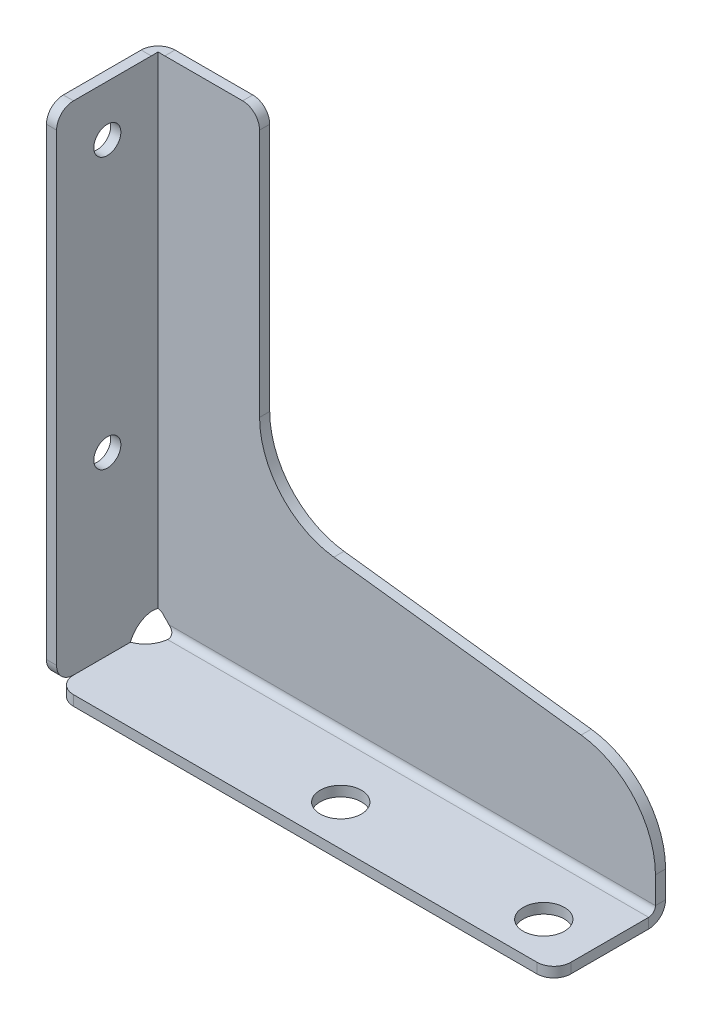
ISO-10303-21;
HEADER;
FILE_DESCRIPTION(('STEP AP214'),'2;1');
FILE_NAME('part.step','',(''),(''),'','','');
FILE_SCHEMA(('AUTOMOTIVE_DESIGN { 1 0 10303 214 1 1 1 1 }'));
ENDSEC;
DATA;
#1=APPLICATION_CONTEXT('core data for automotive mechanical design processes');
#2=APPLICATION_PROTOCOL_DEFINITION('international standard','automotive_design',2000,#1);
#3=PRODUCT_CONTEXT('',#1,'mechanical');
#4=PRODUCT('Part','Part','',(#3));
#5=PRODUCT_RELATED_PRODUCT_CATEGORY('part','',(#4));
#6=PRODUCT_DEFINITION_FORMATION('','',#4);
#7=PRODUCT_DEFINITION_CONTEXT('part definition',#1,'design');
#8=PRODUCT_DEFINITION('design','',#6,#7);
#9=PRODUCT_DEFINITION_SHAPE('','',#8);
#10=(LENGTH_UNIT() NAMED_UNIT(*) SI_UNIT(.MILLI.,.METRE.));
#11=(NAMED_UNIT(*) PLANE_ANGLE_UNIT() SI_UNIT($,.RADIAN.));
#12=(NAMED_UNIT(*) SI_UNIT($,.STERADIAN.) SOLID_ANGLE_UNIT());
#13=UNCERTAINTY_MEASURE_WITH_UNIT(LENGTH_MEASURE(1.E-05),#10,'distance_accuracy_value','');
#14=(GEOMETRIC_REPRESENTATION_CONTEXT(3) GLOBAL_UNCERTAINTY_ASSIGNED_CONTEXT((#13)) GLOBAL_UNIT_ASSIGNED_CONTEXT((#10,
#11,#12)) REPRESENTATION_CONTEXT('',''));
#15=CARTESIAN_POINT('',(0.,0.,0.));
#16=DIRECTION('',(0.,0.,1.));
#17=DIRECTION('',(1.,0.,0.));
#18=AXIS2_PLACEMENT_3D('',#15,#16,#17);
#19=CARTESIAN_POINT('',(136.178536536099,5.85380587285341,3.));
#20=DIRECTION('',(-1.,0.,0.));
#21=DIRECTION('',(0.,0.,1.));
#22=AXIS2_PLACEMENT_3D('',#19,#20,#21);
#23=PLANE('',#22);
#24=DIRECTION('',(0.,1.,0.));
#25=VECTOR('',#24,1.);
#26=CARTESIAN_POINT('',(136.178536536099,5.85380587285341,3.));
#27=LINE('',#26,#25);
#28=CARTESIAN_POINT('',(136.178536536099,-2.03027536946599,3.));
#29=VERTEX_POINT('',#28);
#30=CARTESIAN_POINT('',(136.178536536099,5.85380587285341,3.));
#31=VERTEX_POINT('',#30);
#32=EDGE_CURVE('E318',#29,#31,#27,.T.);
#33=ORIENTED_EDGE('',*,*,#32,.F.);
#34=DIRECTION('',(0.,0.,-1.));
#35=VECTOR('',#34,1.);
#36=CARTESIAN_POINT('',(136.178536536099,-2.030275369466,2.99999999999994));
#37=LINE('',#36,#35);
#38=CARTESIAN_POINT('',(136.178536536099,-2.03027536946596,0.));
#39=VERTEX_POINT('',#38);
#40=EDGE_CURVE('E461',#29,#39,#37,.T.);
#41=ORIENTED_EDGE('',*,*,#40,.T.);
#42=DIRECTION('',(0.,1.,0.));
#43=VECTOR('',#42,1.);
#44=CARTESIAN_POINT('',(136.178536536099,5.85380587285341,0.));
#45=LINE('',#44,#43);
#46=CARTESIAN_POINT('',(136.178536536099,5.85380587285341,0.));
#47=VERTEX_POINT('',#46);
#48=EDGE_CURVE('E323',#39,#47,#45,.T.);
#49=ORIENTED_EDGE('',*,*,#48,.T.);
#50=DIRECTION('',(0.,0.,-1.));
#51=VECTOR('',#50,1.);
#52=CARTESIAN_POINT('',(136.178536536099,5.85380587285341,3.));
#53=LINE('',#52,#51);
#54=EDGE_CURVE('E324',#31,#47,#53,.T.);
#55=ORIENTED_EDGE('',*,*,#54,.F.);
#56=EDGE_LOOP('',(#33,#41,#49,#55));
#57=FACE_BOUND('',#56,.T.);
#58=ADVANCED_FACE('F60',(#57),#23,.F.);
#59=CARTESIAN_POINT('',(44.1785365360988,64.4558627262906,3.));
#60=DIRECTION('',(0.,0.,-1.));
#61=DIRECTION('',(-1.,0.,0.));
#62=AXIS2_PLACEMENT_3D('',#59,#60,#61);
#63=PLANE('',#62);
#64=DIRECTION('',(0.,1.,0.));
#65=VECTOR('',#64,1.);
#66=CARTESIAN_POINT('',(19.1785365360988,142.971937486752,3.));
#67=LINE('',#66,#65);
#68=CARTESIAN_POINT('',(19.1785365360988,64.4558627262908,3.));
#69=VERTEX_POINT('',#68);
#70=CARTESIAN_POINT('',(19.1785365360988,137.971937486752,3.));
#71=VERTEX_POINT('',#70);
#72=EDGE_CURVE('E309',#69,#71,#67,.T.);
#73=ORIENTED_EDGE('',*,*,#72,.T.);
#74=CARTESIAN_POINT('',(14.1785365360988,137.971937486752,3.));
#75=DIRECTION('',(0.,0.,-1.));
#76=DIRECTION('',(-1.,0.,0.));
#77=AXIS2_PLACEMENT_3D('',#74,#75,#76);
#78=CIRCLE('',#77,5.);
#79=CARTESIAN_POINT('',(14.1785365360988,142.971937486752,3.));
#80=VERTEX_POINT('',#79);
#81=EDGE_CURVE('E68',#71,#80,#78,.F.);
#82=ORIENTED_EDGE('',*,*,#81,.T.);
#83=DIRECTION('',(-1.,0.,0.));
#84=VECTOR('',#83,1.);
#85=CARTESIAN_POINT('',(-42.3214634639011,142.971937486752,3.));
#86=LINE('',#85,#84);
#87=CARTESIAN_POINT('',(-8.823676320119,142.971937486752,3.));
#88=VERTEX_POINT('',#87);
#89=EDGE_CURVE('E319',#80,#88,#86,.T.);
#90=ORIENTED_EDGE('',*,*,#89,.T.);
#91=DIRECTION('',(-1.,0.,0.));
#92=VECTOR('',#91,1.);
#93=CARTESIAN_POINT('',(-8.823676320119,142.971937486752,3.));
#94=LINE('',#93,#92);
#95=CARTESIAN_POINT('',(-10.823676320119,142.971937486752,3.));
#96=VERTEX_POINT('',#95);
#97=EDGE_CURVE('E1083',#88,#96,#94,.T.);
#98=ORIENTED_EDGE('',*,*,#97,.T.);
#99=DIRECTION('',(0.,1.,0.));
#100=VECTOR('',#99,1.);
#101=CARTESIAN_POINT('',(-10.8236763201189,-7.03880036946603,3.));
#102=LINE('',#101,#100);
#103=CARTESIAN_POINT('',(-10.8236763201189,0.571064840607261,3.));
#104=VERTEX_POINT('',#103);
#105=EDGE_CURVE('E646',#104,#96,#102,.T.);
#106=ORIENTED_EDGE('',*,*,#105,.F.);
#107=CARTESIAN_POINT('',(-8.82367632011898,-0.794754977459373,3.));
#108=CARTESIAN_POINT('',(-8.8664197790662,-0.738760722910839,3.));
#109=CARTESIAN_POINT('',(-8.9099187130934,-0.683318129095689,3.));
#110=CARTESIAN_POINT('',(-8.99901684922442,-0.573683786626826,3.));
#111=CARTESIAN_POINT('',(-9.04462557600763,-0.519499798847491,3.));
#112=CARTESIAN_POINT('',(-9.13818522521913,-0.413017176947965,3.));
#113=CARTESIAN_POINT('',(-9.18613994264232,-0.360721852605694,3.));
#114=CARTESIAN_POINT('',(-9.28471912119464,-0.258618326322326,3.));
#115=CARTESIAN_POINT('',(-9.33534561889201,-0.208812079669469,3.));
#116=CARTESIAN_POINT('',(-9.43945620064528,-0.11243089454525,3.));
#117=CARTESIAN_POINT('',(-9.49293560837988,-0.0658509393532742,3.));
#118=CARTESIAN_POINT('',(-9.60293380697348,0.0234646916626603,3.));
#119=CARTESIAN_POINT('',(-9.65944953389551,0.066204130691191,3.));
#120=CARTESIAN_POINT('',(-9.78702273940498,0.155306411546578,3.));
#121=CARTESIAN_POINT('',(-9.85875023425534,0.20072201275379,3.));
#122=CARTESIAN_POINT('',(-9.96929129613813,0.263645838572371,3.));
#123=CARTESIAN_POINT('',(-10.006645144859,0.283760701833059,3.));
#124=CARTESIAN_POINT('',(-10.0822474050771,0.322241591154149,3.));
#125=CARTESIAN_POINT('',(-10.1204958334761,0.340607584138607,3.));
#126=CARTESIAN_POINT('',(-10.1976328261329,0.375530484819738,3.));
#127=CARTESIAN_POINT('',(-10.236518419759,0.392093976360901,3.));
#128=CARTESIAN_POINT('',(-10.3149600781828,0.423548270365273,3.));
#129=CARTESIAN_POINT('',(-10.3545161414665,0.43843907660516,3.));
#130=CARTESIAN_POINT('',(-10.4142677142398,0.459560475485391,3.));
#131=CARTESIAN_POINT('',(-10.4342508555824,0.466397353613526,3.));
#132=CARTESIAN_POINT('',(-10.4743671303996,0.479615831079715,3.));
#133=CARTESIAN_POINT('',(-10.4945002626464,0.48599743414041,3.));
#134=CARTESIAN_POINT('',(-10.555086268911,0.504517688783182,3.));
#135=CARTESIAN_POINT('',(-10.5957307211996,0.516033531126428,3.));
#136=CARTESIAN_POINT('',(-10.6675660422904,0.534982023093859,3.));
#137=CARTESIAN_POINT('',(-10.698675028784,0.542729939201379,3.));
#138=CARTESIAN_POINT('',(-10.7610580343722,0.557453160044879,3.));
#139=CARTESIAN_POINT('',(-10.792331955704,0.564428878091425,3.));
#140=CARTESIAN_POINT('',(-10.8236763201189,0.571064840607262,3.));
#141=B_SPLINE_CURVE_WITH_KNOTS('',3,(#107,#108,#109,#110,#111,#112,#113,#114,#115,#116,#117,
#118,#119,#120,#121,#122,#123,#124,#125,#126,#127,#128,#129,#130,#131,#132,#133,#134,#135,#136,
#137,#138,#139,#140),.UNSPECIFIED.,.F.,.F.,(4,2,2,2,2,2,2,2,2,2,2,2,2,2,2,2,4),(0.,
0.211355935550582,0.423782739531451,0.636565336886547,0.84951253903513,1.06212081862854,
1.27451844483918,1.52879656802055,1.656035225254,1.78327628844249,1.91003577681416,
2.03679497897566,2.10015180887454,2.16350812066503,2.29020495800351,2.38637378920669,
2.48249089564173),.UNSPECIFIED.);
#142=CARTESIAN_POINT('',(-8.82367632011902,-0.794754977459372,3.));
#143=VERTEX_POINT('',#142);
#144=EDGE_CURVE('E235',#143,#104,#141,.T.);
#145=ORIENTED_EDGE('',*,*,#144,.F.);
#146=CARTESIAN_POINT('',(-13.4731138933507,-6.67971294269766,3.));
#147=DIRECTION('',(0.,0.,-1.));
#148=DIRECTION('',(1.,0.,0.));
#149=AXIS2_PLACEMENT_3D('',#146,#147,#148);
#150=CIRCLE('',#149,7.49999999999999);
#151=CARTESIAN_POINT('',(-7.58815592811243,-2.03027536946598,3.));
#152=VERTEX_POINT('',#151);
#153=EDGE_CURVE('E322',#143,#152,#150,.T.);
#154=ORIENTED_EDGE('',*,*,#153,.T.);
#155=DIRECTION('',(1.,0.,0.));
#156=VECTOR('',#155,1.);
#157=CARTESIAN_POINT('',(44.1785365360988,-2.03027536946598,3.));
#158=LINE('',#157,#156);
#159=EDGE_CURVE('E278',#152,#29,#158,.T.);
#160=ORIENTED_EDGE('',*,*,#159,.T.);
#161=ORIENTED_EDGE('',*,*,#32,.T.);
#162=CARTESIAN_POINT('',(111.178536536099,5.8538058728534,3.));
#163=DIRECTION('',(0.,0.,1.));
#164=DIRECTION('',(1.,0.,0.));
#165=AXIS2_PLACEMENT_3D('',#162,#163,#164);
#166=CIRCLE('',#165,25.);
#167=CARTESIAN_POINT('',(114.225270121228,30.6674596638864,3.));
#168=VERTEX_POINT('',#167);
#169=EDGE_CURVE('E316',#31,#168,#166,.T.);
#170=ORIENTED_EDGE('',*,*,#169,.T.);
#171=DIRECTION('',(-0.992546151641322,0.12186934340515,0.));
#172=VECTOR('',#171,1.);
#173=CARTESIAN_POINT('',(114.225270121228,30.6674596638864,3.));
#174=LINE('',#173,#172);
#175=CARTESIAN_POINT('',(41.1318029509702,39.6422089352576,3.));
#176=VERTEX_POINT('',#175);
#177=EDGE_CURVE('E314',#168,#176,#174,.T.);
#178=ORIENTED_EDGE('',*,*,#177,.T.);
#179=CARTESIAN_POINT('',(44.1785365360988,64.4558627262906,3.));
#180=DIRECTION('',(0.,0.,-1.));
#181=DIRECTION('',(-1.,0.,0.));
#182=AXIS2_PLACEMENT_3D('',#179,#180,#181);
#183=CIRCLE('',#182,25.);
#184=EDGE_CURVE('E312',#176,#69,#183,.T.);
#185=ORIENTED_EDGE('',*,*,#184,.T.);
#186=EDGE_LOOP('',(#73,#82,#90,#98,#106,#145,#154,#160,#161,#170,#178,#185));
#187=FACE_BOUND('',#186,.T.);
#188=ADVANCED_FACE('F385',(#187),#63,.F.);
#189=CARTESIAN_POINT('',(-13.4731138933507,-6.67971294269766,3.));
#190=DIRECTION('',(0.,0.,-1.));
#191=DIRECTION('',(-1.,0.,0.));
#192=AXIS2_PLACEMENT_3D('',#189,#190,#191);
#193=CYLINDRICAL_SURFACE('',#192,7.49999999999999);
#194=CARTESIAN_POINT('',(-13.4731138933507,-6.67971294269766,0.));
#195=DIRECTION('',(0.,0.,-1.));
#196=DIRECTION('',(1.,0.,0.));
#197=AXIS2_PLACEMENT_3D('',#194,#195,#196);
#198=CIRCLE('',#197,7.49999999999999);
#199=CARTESIAN_POINT('',(-8.82367632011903,-0.794754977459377,0.));
#200=VERTEX_POINT('',#199);
#201=CARTESIAN_POINT('',(-7.58815592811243,-2.03027536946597,0.));
#202=VERTEX_POINT('',#201);
#203=EDGE_CURVE('E302',#200,#202,#198,.T.);
#204=ORIENTED_EDGE('',*,*,#203,.T.);
#205=CARTESIAN_POINT('',(-7.58815592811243,-2.03027536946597,3.));
#206=CARTESIAN_POINT('',(-7.58815592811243,-2.03027536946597,0.));
#207=B_SPLINE_CURVE_WITH_KNOTS('',1,(#205,#206),.UNSPECIFIED.,.F.,.F.,(2,2),(0.,1.),.UNSPECIFIED.);
#208=EDGE_CURVE('E285',#202,#152,#207,.F.);
#209=ORIENTED_EDGE('',*,*,#208,.T.);
#210=ORIENTED_EDGE('',*,*,#153,.F.);
#211=CARTESIAN_POINT('',(-8.82367632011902,-0.794754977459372,0.));
#212=CARTESIAN_POINT('',(-8.82367632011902,-0.794754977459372,3.));
#213=B_SPLINE_CURVE_WITH_KNOTS('',1,(#211,#212),.UNSPECIFIED.,.F.,.F.,(2,2),(0.,1.),.UNSPECIFIED.);
#214=EDGE_CURVE('E311',#143,#200,#213,.F.);
#215=ORIENTED_EDGE('',*,*,#214,.T.);
#216=EDGE_LOOP('',(#204,#209,#210,#215));
#217=FACE_BOUND('',#216,.T.);
#218=ADVANCED_FACE('F376',(#217),#193,.F.);
#219=CARTESIAN_POINT('',(-13.8236763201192,64.4558627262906,-53.5));
#220=DIRECTION('',(-1.,0.,0.));
#221=DIRECTION('',(0.,0.,1.));
#222=AXIS2_PLACEMENT_3D('',#219,#220,#221);
#223=PLANE('',#222);
#224=CARTESIAN_POINT('',(-13.8236763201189,127.971937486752,18.));
#225=DIRECTION('',(-1.,0.,0.));
#226=DIRECTION('',(0.,0.,1.));
#227=AXIS2_PLACEMENT_3D('',#224,#225,#226);
#228=CIRCLE('',#227,4.);
#229=CARTESIAN_POINT('',(-13.8236763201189,127.971937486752,22.));
#230=VERTEX_POINT('',#229);
#231=EDGE_CURVE('E466',#230,#230,#228,.T.);
#232=ORIENTED_EDGE('',*,*,#231,.F.);
#233=EDGE_LOOP('',(#232));
#234=FACE_BOUND('',#233,.T.);
#235=CARTESIAN_POINT('',(-13.823676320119,47.9719374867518,18.));
#236=DIRECTION('',(-1.,0.,0.));
#237=DIRECTION('',(0.,0.,1.));
#238=AXIS2_PLACEMENT_3D('',#235,#236,#237);
#239=CIRCLE('',#238,4.);
#240=CARTESIAN_POINT('',(-13.8236763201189,47.9719374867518,22.));
#241=VERTEX_POINT('',#240);
#242=EDGE_CURVE('E465',#241,#241,#239,.T.);
#243=ORIENTED_EDGE('',*,*,#242,.F.);
#244=EDGE_LOOP('',(#243));
#245=FACE_BOUND('',#244,.T.);
#246=DIRECTION('',(0.,0.,-1.));
#247=VECTOR('',#246,1.);
#248=CARTESIAN_POINT('',(-13.8236763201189,-4.02806251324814,33.));
#249=LINE('',#248,#247);
#250=CARTESIAN_POINT('',(-13.8236763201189,-4.02806251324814,28.));
#251=VERTEX_POINT('',#250);
#252=CARTESIAN_POINT('',(-13.823676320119,-4.02806251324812,11.1672580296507));
#253=VERTEX_POINT('',#252);
#254=EDGE_CURVE('E270',#251,#253,#249,.T.);
#255=ORIENTED_EDGE('',*,*,#254,.F.);
#256=CARTESIAN_POINT('',(-13.8236763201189,0.971937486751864,28.));
#257=DIRECTION('',(-1.,0.,0.));
#258=DIRECTION('',(0.,0.,1.));
#259=AXIS2_PLACEMENT_3D('',#256,#257,#258);
#260=CIRCLE('',#259,5.);
#261=CARTESIAN_POINT('',(-13.8236763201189,0.971937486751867,33.));
#262=VERTEX_POINT('',#261);
#263=EDGE_CURVE('E438',#251,#262,#260,.T.);
#264=ORIENTED_EDGE('',*,*,#263,.T.);
#265=DIRECTION('',(0.,-1.,0.));
#266=VECTOR('',#265,1.);
#267=CARTESIAN_POINT('',(-13.8236763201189,142.971937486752,33.));
#268=LINE('',#267,#266);
#269=CARTESIAN_POINT('',(-13.8236763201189,137.971937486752,33.));
#270=VERTEX_POINT('',#269);
#271=EDGE_CURVE('E290',#270,#262,#268,.T.);
#272=ORIENTED_EDGE('',*,*,#271,.F.);
#273=CARTESIAN_POINT('',(-13.8236763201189,137.971937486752,28.));
#274=DIRECTION('',(-1.,0.,0.));
#275=DIRECTION('',(0.,0.,1.));
#276=AXIS2_PLACEMENT_3D('',#273,#274,#275);
#277=CIRCLE('',#276,5.);
#278=CARTESIAN_POINT('',(-13.8236763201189,142.971937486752,28.));
#279=VERTEX_POINT('',#278);
#280=EDGE_CURVE('E440',#270,#279,#277,.T.);
#281=ORIENTED_EDGE('',*,*,#280,.T.);
#282=DIRECTION('',(0.,0.,1.));
#283=VECTOR('',#282,1.);
#284=CARTESIAN_POINT('',(-13.8236763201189,142.971937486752,33.));
#285=LINE('',#284,#283);
#286=CARTESIAN_POINT('',(-13.823676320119,142.971937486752,5.00000000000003));
#287=VERTEX_POINT('',#286);
#288=EDGE_CURVE('E288',#287,#279,#285,.T.);
#289=ORIENTED_EDGE('',*,*,#288,.F.);
#290=DIRECTION('',(0.,-1.,0.));
#291=VECTOR('',#290,1.);
#292=CARTESIAN_POINT('',(-13.823676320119,64.4558627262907,5.00000000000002));
#293=LINE('',#292,#291);
#294=CARTESIAN_POINT('',(-13.823676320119,0.772152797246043,5.00000000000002));
#295=VERTEX_POINT('',#294);
#296=EDGE_CURVE('E250',#287,#295,#293,.T.);
#297=ORIENTED_EDGE('',*,*,#296,.T.);
#298=CARTESIAN_POINT('',(-13.823676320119,-6.67971294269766,4.15165042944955));
#299=DIRECTION('',(-1.,0.,0.));
#300=DIRECTION('',(0.,0.,-1.));
#301=AXIS2_PLACEMENT_3D('',#298,#299,#300);
#302=CIRCLE('',#301,7.49999999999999);
#303=EDGE_CURVE('E248',#253,#295,#302,.T.);
#304=ORIENTED_EDGE('',*,*,#303,.F.);
#305=EDGE_LOOP('',(#255,#264,#272,#281,#289,#297,#304));
#306=FACE_BOUND('',#305,.T.);
#307=ADVANCED_FACE('F373',(#234,#245,#306),#223,.T.);
#308=CARTESIAN_POINT('',(-10.8236763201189,142.971937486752,33.));
#309=DIRECTION('',(0.,-1.,0.));
#310=DIRECTION('',(0.,0.,-1.));
#311=AXIS2_PLACEMENT_3D('',#308,#309,#310);
#312=PLANE('',#311);
#313=ORIENTED_EDGE('',*,*,#288,.T.);
#314=DIRECTION('',(-1.,0.,0.));
#315=VECTOR('',#314,1.);
#316=CARTESIAN_POINT('',(-10.8236763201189,142.971937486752,28.));
#317=LINE('',#316,#315);
#318=CARTESIAN_POINT('',(-10.8236763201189,142.971937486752,28.));
#319=VERTEX_POINT('',#318);
#320=EDGE_CURVE('E12',#279,#319,#317,.F.);
#321=ORIENTED_EDGE('',*,*,#320,.T.);
#322=DIRECTION('',(0.,0.,1.));
#323=VECTOR('',#322,1.);
#324=CARTESIAN_POINT('',(-10.8236763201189,142.971937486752,33.));
#325=LINE('',#324,#323);
#326=CARTESIAN_POINT('',(-10.823676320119,142.971937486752,5.00000000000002));
#327=VERTEX_POINT('',#326);
#328=EDGE_CURVE('E265',#327,#319,#325,.T.);
#329=ORIENTED_EDGE('',*,*,#328,.F.);
#330=DIRECTION('',(1.,0.,0.));
#331=VECTOR('',#330,1.);
#332=CARTESIAN_POINT('',(-10.823676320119,142.971937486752,5.00000000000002));
#333=LINE('',#332,#331);
#334=EDGE_CURVE('E273',#287,#327,#333,.T.);
#335=ORIENTED_EDGE('',*,*,#334,.F.);
#336=EDGE_LOOP('',(#313,#321,#329,#335));
#337=FACE_BOUND('',#336,.T.);
#338=ADVANCED_FACE('F375',(#337),#312,.F.);
#339=CARTESIAN_POINT('',(-10.8236763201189,142.971937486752,33.));
#340=DIRECTION('',(0.,0.,-1.));
#341=DIRECTION('',(-1.,0.,0.));
#342=AXIS2_PLACEMENT_3D('',#339,#340,#341);
#343=PLANE('',#342);
#344=ORIENTED_EDGE('',*,*,#271,.T.);
#345=DIRECTION('',(-1.,0.,0.));
#346=VECTOR('',#345,1.);
#347=CARTESIAN_POINT('',(-10.8236763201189,0.971937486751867,33.));
#348=LINE('',#347,#346);
#349=CARTESIAN_POINT('',(-10.8236763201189,0.971937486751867,33.));
#350=VERTEX_POINT('',#349);
#351=EDGE_CURVE('E433',#262,#350,#348,.F.);
#352=ORIENTED_EDGE('',*,*,#351,.T.);
#353=DIRECTION('',(0.,-1.,0.));
#354=VECTOR('',#353,1.);
#355=CARTESIAN_POINT('',(-10.8236763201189,142.971937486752,33.));
#356=LINE('',#355,#354);
#357=CARTESIAN_POINT('',(-10.8236763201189,137.971937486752,33.));
#358=VERTEX_POINT('',#357);
#359=EDGE_CURVE('E261',#358,#350,#356,.T.);
#360=ORIENTED_EDGE('',*,*,#359,.F.);
#361=DIRECTION('',(-1.,0.,0.));
#362=VECTOR('',#361,1.);
#363=CARTESIAN_POINT('',(-10.8236763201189,137.971937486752,33.));
#364=LINE('',#363,#362);
#365=EDGE_CURVE('E435',#358,#270,#364,.T.);
#366=ORIENTED_EDGE('',*,*,#365,.T.);
#367=EDGE_LOOP('',(#344,#352,#360,#366));
#368=FACE_BOUND('',#367,.T.);
#369=ADVANCED_FACE('F383',(#368),#343,.F.);
#370=CARTESIAN_POINT('',(-10.8236763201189,-4.02806251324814,33.));
#371=DIRECTION('',(0.,1.,0.));
#372=DIRECTION('',(0.,0.,1.));
#373=AXIS2_PLACEMENT_3D('',#370,#371,#372);
#374=PLANE('',#373);
#375=DIRECTION('',(0.,0.,-1.));
#376=VECTOR('',#375,1.);
#377=CARTESIAN_POINT('',(-10.8236763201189,-4.02806251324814,33.));
#378=LINE('',#377,#376);
#379=CARTESIAN_POINT('',(-10.8236763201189,-4.02806251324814,28.));
#380=VERTEX_POINT('',#379);
#381=CARTESIAN_POINT('',(-10.823676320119,-4.02806251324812,11.1672580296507));
#382=VERTEX_POINT('',#381);
#383=EDGE_CURVE('E257',#380,#382,#378,.T.);
#384=ORIENTED_EDGE('',*,*,#383,.F.);
#385=DIRECTION('',(-1.,0.,0.));
#386=VECTOR('',#385,1.);
#387=CARTESIAN_POINT('',(-10.8236763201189,-4.02806251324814,28.));
#388=LINE('',#387,#386);
#389=EDGE_CURVE('E372',#380,#251,#388,.T.);
#390=ORIENTED_EDGE('',*,*,#389,.T.);
#391=ORIENTED_EDGE('',*,*,#254,.T.);
#392=DIRECTION('',(-1.,0.,0.));
#393=VECTOR('',#392,1.);
#394=CARTESIAN_POINT('',(-10.823676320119,-4.02806251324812,11.1672580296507));
#395=LINE('',#394,#393);
#396=EDGE_CURVE('E251',#382,#253,#395,.T.);
#397=ORIENTED_EDGE('',*,*,#396,.F.);
#398=EDGE_LOOP('',(#384,#390,#391,#397));
#399=FACE_BOUND('',#398,.T.);
#400=ADVANCED_FACE('F370',(#399),#374,.F.);
#401=CARTESIAN_POINT('',(-10.823676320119,-6.67971294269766,4.15165042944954));
#402=DIRECTION('',(-1.,0.,0.));
#403=DIRECTION('',(0.,0.,1.));
#404=AXIS2_PLACEMENT_3D('',#401,#402,#403);
#405=CYLINDRICAL_SURFACE('',#404,7.49999999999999);
#406=CARTESIAN_POINT('',(-10.823676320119,0.772152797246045,5.));
#407=CARTESIAN_POINT('',(-13.823676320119,0.772152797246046,5.));
#408=B_SPLINE_CURVE_WITH_KNOTS('',1,(#406,#407),.UNSPECIFIED.,.F.,.F.,(2,2),(0.,1.),.UNSPECIFIED.);
#409=CARTESIAN_POINT('',(-10.823676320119,0.772152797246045,5.));
#410=VERTEX_POINT('',#409);
#411=EDGE_CURVE('E231',#410,#295,#408,.T.);
#412=ORIENTED_EDGE('',*,*,#411,.F.);
#413=CARTESIAN_POINT('',(-10.823676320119,-6.67971294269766,4.15165042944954));
#414=DIRECTION('',(-1.,0.,0.));
#415=DIRECTION('',(0.,0.,-1.));
#416=AXIS2_PLACEMENT_3D('',#413,#414,#415);
#417=CIRCLE('',#416,7.49999999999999);
#418=EDGE_CURVE('E246',#382,#410,#417,.T.);
#419=ORIENTED_EDGE('',*,*,#418,.F.);
#420=ORIENTED_EDGE('',*,*,#396,.T.);
#421=ORIENTED_EDGE('',*,*,#303,.T.);
#422=EDGE_LOOP('',(#412,#419,#420,#421));
#423=FACE_BOUND('',#422,.T.);
#424=ADVANCED_FACE('F244',(#423),#405,.F.);
#425=CARTESIAN_POINT('',(-10.8236763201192,64.4558627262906,-53.5));
#426=DIRECTION('',(-1.,0.,0.));
#427=DIRECTION('',(0.,0.,1.));
#428=AXIS2_PLACEMENT_3D('',#425,#426,#427);
#429=PLANE('',#428);
#430=CARTESIAN_POINT('',(-10.8236763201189,127.971937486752,18.));
#431=DIRECTION('',(-1.,0.,0.));
#432=DIRECTION('',(0.,0.,1.));
#433=AXIS2_PLACEMENT_3D('',#430,#431,#432);
#434=CIRCLE('',#433,4.);
#435=CARTESIAN_POINT('',(-10.8236763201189,127.971937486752,22.));
#436=VERTEX_POINT('',#435);
#437=EDGE_CURVE('E462',#436,#436,#434,.T.);
#438=ORIENTED_EDGE('',*,*,#437,.T.);
#439=EDGE_LOOP('',(#438));
#440=FACE_BOUND('',#439,.T.);
#441=CARTESIAN_POINT('',(-10.823676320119,47.9719374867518,18.));
#442=DIRECTION('',(-1.,0.,0.));
#443=DIRECTION('',(0.,0.,1.));
#444=AXIS2_PLACEMENT_3D('',#441,#442,#443);
#445=CIRCLE('',#444,3.99999999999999);
#446=CARTESIAN_POINT('',(-10.8236763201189,47.9719374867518,22.));
#447=VERTEX_POINT('',#446);
#448=EDGE_CURVE('E1100',#447,#447,#445,.T.);
#449=ORIENTED_EDGE('',*,*,#448,.T.);
#450=EDGE_LOOP('',(#449));
#451=FACE_BOUND('',#450,.T.);
#452=ORIENTED_EDGE('',*,*,#359,.T.);
#453=CARTESIAN_POINT('',(-10.8236763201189,0.971937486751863,28.));
#454=DIRECTION('',(-1.,0.,0.));
#455=DIRECTION('',(0.,0.,1.));
#456=AXIS2_PLACEMENT_3D('',#453,#454,#455);
#457=CIRCLE('',#456,5.);
#458=EDGE_CURVE('E429',#350,#380,#457,.F.);
#459=ORIENTED_EDGE('',*,*,#458,.T.);
#460=ORIENTED_EDGE('',*,*,#383,.T.);
#461=ORIENTED_EDGE('',*,*,#418,.T.);
#462=CARTESIAN_POINT('',(-10.8236763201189,0.571064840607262,3.));
#463=CARTESIAN_POINT('',(-10.8236763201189,0.584239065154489,3.06229642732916));
#464=CARTESIAN_POINT('',(-10.8236763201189,0.597246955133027,3.12463030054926));
#465=CARTESIAN_POINT('',(-10.8236763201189,0.622691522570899,3.2494110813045));
#466=CARTESIAN_POINT('',(-10.8236763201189,0.635128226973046,3.31185798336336));
#467=CARTESIAN_POINT('',(-10.8236763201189,0.65914806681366,3.43667447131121));
#468=CARTESIAN_POINT('',(-10.8236763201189,0.670734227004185,3.49904346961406));
#469=CARTESIAN_POINT('',(-10.823676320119,0.692826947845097,3.62398562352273));
#470=CARTESIAN_POINT('',(-10.823676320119,0.703333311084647,3.68655881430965));
#471=CARTESIAN_POINT('',(-10.823676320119,0.723873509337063,3.81793450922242));
#472=CARTESIAN_POINT('',(-10.823676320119,0.733765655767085,3.88675951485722));
#473=CARTESIAN_POINT('',(-10.8236763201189,0.751385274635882,4.0246830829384));
#474=CARTESIAN_POINT('',(-10.8236763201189,0.759112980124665,4.09378161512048));
#475=CARTESIAN_POINT('',(-10.8236763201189,0.77198150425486,4.23219684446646));
#476=CARTESIAN_POINT('',(-10.8236763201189,0.777123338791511,4.30151344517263));
#477=CARTESIAN_POINT('',(-10.8236763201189,0.784476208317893,4.44069748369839));
#478=CARTESIAN_POINT('',(-10.8236763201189,0.786670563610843,4.51056582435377));
#479=CARTESIAN_POINT('',(-10.8236763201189,0.787870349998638,4.65037853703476));
#480=CARTESIAN_POINT('',(-10.8236763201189,0.786873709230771,4.72032292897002));
#481=CARTESIAN_POINT('',(-10.8236763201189,0.783043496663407,4.82521010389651));
#482=CARTESIAN_POINT('',(-10.8236763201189,0.781374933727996,4.86019981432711));
#483=CARTESIAN_POINT('',(-10.8236763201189,0.777303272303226,4.93013531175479));
#484=CARTESIAN_POINT('',(-10.823676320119,0.774900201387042,4.96508110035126));
#485=CARTESIAN_POINT('',(-10.8236763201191,0.772152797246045,5.));
#486=B_SPLINE_CURVE_WITH_KNOTS('',3,(#462,#463,#464,#465,#466,#467,#468,#469,#470,#471,#472,
#473,#474,#475,#476,#477,#478,#479,#480,#481,#482,#483,#484,#485),.UNSPECIFIED.,.F.,.F.,(4,2,2,
2,2,2,2,2,2,2,2,4),(0.,0.191025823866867,0.38204262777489,0.572343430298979,0.762678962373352,
0.971248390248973,1.17979535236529,1.38826031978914,1.59790008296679,1.80767598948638,
1.91275773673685,2.01783553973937),.UNSPECIFIED.);
#487=EDGE_CURVE('E228',#104,#410,#486,.T.);
#488=ORIENTED_EDGE('',*,*,#487,.F.);
#489=ORIENTED_EDGE('',*,*,#105,.T.);
#490=DIRECTION('',(0.,0.,1.));
#491=VECTOR('',#490,1.);
#492=CARTESIAN_POINT('',(-10.823676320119,142.971937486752,5.00000000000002));
#493=LINE('',#492,#491);
#494=EDGE_CURVE('E239',#96,#327,#493,.T.);
#495=ORIENTED_EDGE('',*,*,#494,.T.);
#496=ORIENTED_EDGE('',*,*,#328,.T.);
#497=CARTESIAN_POINT('',(-10.8236763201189,137.971937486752,28.));
#498=DIRECTION('',(-1.,0.,0.));
#499=DIRECTION('',(0.,0.,1.));
#500=AXIS2_PLACEMENT_3D('',#497,#498,#499);
#501=CIRCLE('',#500,5.);
#502=EDGE_CURVE('E431',#319,#358,#501,.F.);
#503=ORIENTED_EDGE('',*,*,#502,.T.);
#504=EDGE_LOOP('',(#452,#459,#460,#461,#488,#489,#495,#496,#503));
#505=FACE_BOUND('',#504,.T.);
#506=ADVANCED_FACE('F255',(#440,#451,#505),#429,.F.);
#507=CARTESIAN_POINT('',(19.1785365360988,142.971937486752,3.));
#508=DIRECTION('',(-1.,0.,0.));
#509=DIRECTION('',(0.,-1.,0.));
#510=AXIS2_PLACEMENT_3D('',#507,#508,#509);
#511=PLANE('',#510);
#512=DIRECTION('',(0.,1.,0.));
#513=VECTOR('',#512,1.);
#514=CARTESIAN_POINT('',(19.1785365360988,142.971937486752,0.));
#515=LINE('',#514,#513);
#516=CARTESIAN_POINT('',(19.1785365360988,64.4558627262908,0.));
#517=VERTEX_POINT('',#516);
#518=CARTESIAN_POINT('',(19.1785365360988,137.971937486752,0.));
#519=VERTEX_POINT('',#518);
#520=EDGE_CURVE('E342',#517,#519,#515,.T.);
#521=ORIENTED_EDGE('',*,*,#520,.T.);
#522=DIRECTION('',(0.,0.,-1.));
#523=VECTOR('',#522,1.);
#524=CARTESIAN_POINT('',(19.1785365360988,137.971937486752,3.));
#525=LINE('',#524,#523);
#526=EDGE_CURVE('E75',#519,#71,#525,.F.);
#527=ORIENTED_EDGE('',*,*,#526,.T.);
#528=ORIENTED_EDGE('',*,*,#72,.F.);
#529=DIRECTION('',(0.,0.,-1.));
#530=VECTOR('',#529,1.);
#531=CARTESIAN_POINT('',(19.1785365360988,64.4558627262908,3.));
#532=LINE('',#531,#530);
#533=EDGE_CURVE('E339',#69,#517,#532,.T.);
#534=ORIENTED_EDGE('',*,*,#533,.T.);
#535=EDGE_LOOP('',(#521,#527,#528,#534));
#536=FACE_BOUND('',#535,.T.);
#537=ADVANCED_FACE('F618',(#536),#511,.F.);
#538=CARTESIAN_POINT('',(44.1785365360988,64.4558627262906,3.));
#539=DIRECTION('',(0.,0.,-1.));
#540=DIRECTION('',(-1.,0.,0.));
#541=AXIS2_PLACEMENT_3D('',#538,#539,#540);
#542=CYLINDRICAL_SURFACE('',#541,25.);
#543=CARTESIAN_POINT('',(44.1785365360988,64.4558627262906,0.));
#544=DIRECTION('',(0.,0.,-1.));
#545=DIRECTION('',(-1.,0.,0.));
#546=AXIS2_PLACEMENT_3D('',#543,#544,#545);
#547=CIRCLE('',#546,25.);
#548=CARTESIAN_POINT('',(41.1318029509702,39.6422089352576,0.));
#549=VERTEX_POINT('',#548);
#550=EDGE_CURVE('E337',#549,#517,#547,.T.);
#551=ORIENTED_EDGE('',*,*,#550,.T.);
#552=ORIENTED_EDGE('',*,*,#533,.F.);
#553=ORIENTED_EDGE('',*,*,#184,.F.);
#554=DIRECTION('',(0.,0.,-1.));
#555=VECTOR('',#554,1.);
#556=CARTESIAN_POINT('',(41.1318029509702,39.6422089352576,3.));
#557=LINE('',#556,#555);
#558=EDGE_CURVE('E334',#176,#549,#557,.T.);
#559=ORIENTED_EDGE('',*,*,#558,.T.);
#560=EDGE_LOOP('',(#551,#552,#553,#559));
#561=FACE_BOUND('',#560,.T.);
#562=ADVANCED_FACE('F792',(#561),#542,.F.);
#563=CARTESIAN_POINT('',(114.225270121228,30.6674596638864,3.));
#564=DIRECTION('',(-0.12186934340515,-0.992546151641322,0.));
#565=DIRECTION('',(0.992546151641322,-0.12186934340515,0.));
#566=AXIS2_PLACEMENT_3D('',#563,#564,#565);
#567=PLANE('',#566);
#568=DIRECTION('',(-0.992546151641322,0.12186934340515,0.));
#569=VECTOR('',#568,1.);
#570=CARTESIAN_POINT('',(114.225270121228,30.6674596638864,0.));
#571=LINE('',#570,#569);
#572=CARTESIAN_POINT('',(114.225270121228,30.6674596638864,0.));
#573=VERTEX_POINT('',#572);
#574=EDGE_CURVE('E332',#573,#549,#571,.T.);
#575=ORIENTED_EDGE('',*,*,#574,.T.);
#576=ORIENTED_EDGE('',*,*,#558,.F.);
#577=ORIENTED_EDGE('',*,*,#177,.F.);
#578=DIRECTION('',(0.,0.,-1.));
#579=VECTOR('',#578,1.);
#580=CARTESIAN_POINT('',(114.225270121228,30.6674596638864,3.));
#581=LINE('',#580,#579);
#582=EDGE_CURVE('E329',#168,#573,#581,.T.);
#583=ORIENTED_EDGE('',*,*,#582,.T.);
#584=EDGE_LOOP('',(#575,#576,#577,#583));
#585=FACE_BOUND('',#584,.T.);
#586=ADVANCED_FACE('F789',(#585),#567,.F.);
#587=CARTESIAN_POINT('',(111.178536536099,5.8538058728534,3.));
#588=DIRECTION('',(0.,0.,-1.));
#589=DIRECTION('',(-1.,0.,0.));
#590=AXIS2_PLACEMENT_3D('',#587,#588,#589);
#591=CYLINDRICAL_SURFACE('',#590,25.);
#592=CARTESIAN_POINT('',(111.178536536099,5.8538058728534,0.));
#593=DIRECTION('',(0.,0.,1.));
#594=DIRECTION('',(1.,0.,0.));
#595=AXIS2_PLACEMENT_3D('',#592,#593,#594);
#596=CIRCLE('',#595,25.);
#597=EDGE_CURVE('E327',#47,#573,#596,.T.);
#598=ORIENTED_EDGE('',*,*,#597,.T.);
#599=ORIENTED_EDGE('',*,*,#582,.F.);
#600=ORIENTED_EDGE('',*,*,#169,.F.);
#601=ORIENTED_EDGE('',*,*,#54,.T.);
#602=EDGE_LOOP('',(#598,#599,#600,#601));
#603=FACE_BOUND('',#602,.T.);
#604=ADVANCED_FACE('F786',(#603),#591,.T.);
#605=CARTESIAN_POINT('',(44.1785365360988,64.4558627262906,0.));
#606=DIRECTION('',(0.,0.,-1.));
#607=DIRECTION('',(-1.,0.,0.));
#608=AXIS2_PLACEMENT_3D('',#605,#606,#607);
#609=PLANE('',#608);
#610=DIRECTION('',(-1.,0.,0.));
#611=VECTOR('',#610,1.);
#612=CARTESIAN_POINT('',(-42.3214634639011,142.971937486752,0.));
#613=LINE('',#612,#611);
#614=CARTESIAN_POINT('',(14.1785365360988,142.971937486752,0.));
#615=VERTEX_POINT('',#614);
#616=CARTESIAN_POINT('',(-8.823676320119,142.971937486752,0.));
#617=VERTEX_POINT('',#616);
#618=EDGE_CURVE('E297',#615,#617,#613,.T.);
#619=ORIENTED_EDGE('',*,*,#618,.F.);
#620=CARTESIAN_POINT('',(14.1785365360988,137.971937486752,0.));
#621=DIRECTION('',(0.,0.,-1.));
#622=DIRECTION('',(-1.,0.,0.));
#623=AXIS2_PLACEMENT_3D('',#620,#621,#622);
#624=CIRCLE('',#623,5.);
#625=EDGE_CURVE('E83',#615,#519,#624,.T.);
#626=ORIENTED_EDGE('',*,*,#625,.T.);
#627=ORIENTED_EDGE('',*,*,#520,.F.);
#628=ORIENTED_EDGE('',*,*,#550,.F.);
#629=ORIENTED_EDGE('',*,*,#574,.F.);
#630=ORIENTED_EDGE('',*,*,#597,.F.);
#631=ORIENTED_EDGE('',*,*,#48,.F.);
#632=DIRECTION('',(1.,0.,0.));
#633=VECTOR('',#632,1.);
#634=CARTESIAN_POINT('',(44.1785365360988,-2.03027536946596,0.));
#635=LINE('',#634,#633);
#636=EDGE_CURVE('E757',#202,#39,#635,.T.);
#637=ORIENTED_EDGE('',*,*,#636,.F.);
#638=ORIENTED_EDGE('',*,*,#203,.F.);
#639=DIRECTION('',(0.,-1.,0.));
#640=VECTOR('',#639,1.);
#641=CARTESIAN_POINT('',(-8.82367632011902,64.4558627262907,0.));
#642=LINE('',#641,#640);
#643=EDGE_CURVE('E344',#617,#200,#642,.T.);
#644=ORIENTED_EDGE('',*,*,#643,.F.);
#645=EDGE_LOOP('',(#619,#626,#627,#628,#629,#630,#631,#637,#638,#644));
#646=FACE_BOUND('',#645,.T.);
#647=ADVANCED_FACE('F401',(#646),#609,.T.);
#648=CARTESIAN_POINT('',(-42.3214634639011,142.971937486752,3.));
#649=DIRECTION('',(0.,-1.,0.));
#650=DIRECTION('',(1.,0.,0.));
#651=AXIS2_PLACEMENT_3D('',#648,#649,#650);
#652=PLANE('',#651);
#653=ORIENTED_EDGE('',*,*,#89,.F.);
#654=DIRECTION('',(0.,0.,-1.));
#655=VECTOR('',#654,1.);
#656=CARTESIAN_POINT('',(14.1785365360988,142.971937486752,3.));
#657=LINE('',#656,#655);
#658=EDGE_CURVE('E424',#80,#615,#657,.T.);
#659=ORIENTED_EDGE('',*,*,#658,.T.);
#660=ORIENTED_EDGE('',*,*,#618,.T.);
#661=DIRECTION('',(0.,0.,1.));
#662=VECTOR('',#661,1.);
#663=CARTESIAN_POINT('',(-8.823676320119,142.971937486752,3.));
#664=LINE('',#663,#662);
#665=EDGE_CURVE('E291',#617,#88,#664,.T.);
#666=ORIENTED_EDGE('',*,*,#665,.T.);
#667=EDGE_LOOP('',(#653,#659,#660,#666));
#668=FACE_BOUND('',#667,.T.);
#669=ADVANCED_FACE('F612',(#668),#652,.F.);
#670=CARTESIAN_POINT('',(-8.82367632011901,142.971937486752,5.));
#671=DIRECTION('',(0.,-1.,0.));
#672=DIRECTION('',(0.,0.,-1.));
#673=AXIS2_PLACEMENT_3D('',#670,#671,#672);
#674=PLANE('',#673);
#675=ORIENTED_EDGE('',*,*,#494,.F.);
#676=ORIENTED_EDGE('',*,*,#97,.F.);
#677=ORIENTED_EDGE('',*,*,#665,.F.);
#678=CARTESIAN_POINT('',(-8.82367632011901,142.971937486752,5.));
#679=DIRECTION('',(0.,-1.,0.));
#680=DIRECTION('',(1.,0.,0.));
#681=AXIS2_PLACEMENT_3D('',#678,#679,#680);
#682=CIRCLE('',#681,5.);
#683=EDGE_CURVE('E588',#617,#287,#682,.F.);
#684=ORIENTED_EDGE('',*,*,#683,.T.);
#685=ORIENTED_EDGE('',*,*,#334,.T.);
#686=EDGE_LOOP('',(#675,#676,#677,#684,#685));
#687=FACE_BOUND('',#686,.T.);
#688=ADVANCED_FACE('F610',(#687),#674,.F.);
#689=CARTESIAN_POINT('',(-13.823676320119,0.772152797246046,5.));
#690=CARTESIAN_POINT('',(-13.823676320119,0.800889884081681,4.08615702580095));
#691=CARTESIAN_POINT('',(-13.5746800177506,0.789072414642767,3.27128389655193));
#692=CARTESIAN_POINT('',(-13.0386551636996,0.711057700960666,2.28447477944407));
#693=CARTESIAN_POINT('',(-12.8329011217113,0.674974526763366,1.99372825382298));
#694=CARTESIAN_POINT('',(-12.5062991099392,0.605732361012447,1.61382550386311));
#695=CARTESIAN_POINT('',(-12.3943916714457,0.580132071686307,1.49648548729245));
#696=CARTESIAN_POINT('',(-12.224358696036,0.537952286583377,1.33373283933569));
#697=CARTESIAN_POINT('',(-12.1673158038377,0.523262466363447,1.28168838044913));
#698=CARTESIAN_POINT('',(-12.0528580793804,0.492623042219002,1.18186544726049));
#699=CARTESIAN_POINT('',(-11.9934487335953,0.476097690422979,1.13249889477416));
#700=CARTESIAN_POINT('',(-11.494486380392,0.332063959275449,0.735239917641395));
#701=CARTESIAN_POINT('',(-10.9931824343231,0.163478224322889,0.460482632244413));
#702=CARTESIAN_POINT('',(-9.93452528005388,-0.254804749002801,0.0928634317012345));
#703=CARTESIAN_POINT('',(-9.37740729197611,-0.504508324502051,0.));
#704=CARTESIAN_POINT('',(-8.82367632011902,-0.794754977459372,0.));
#705=CARTESIAN_POINT('',(-10.823676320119,0.772152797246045,5.));
#706=CARTESIAN_POINT('',(-10.823676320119,0.800889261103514,4.63447073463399));
#707=CARTESIAN_POINT('',(-10.7240777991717,0.789072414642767,4.30851355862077));
#708=CARTESIAN_POINT('',(-10.5096678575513,0.711057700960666,3.91378991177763));
#709=CARTESIAN_POINT('',(-10.4273662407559,0.674974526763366,3.79749130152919));
#710=CARTESIAN_POINT('',(-10.2967254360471,0.605732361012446,3.64553020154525));
#711=CARTESIAN_POINT('',(-10.2519624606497,0.580132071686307,3.59859419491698));
#712=CARTESIAN_POINT('',(-10.1839492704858,0.537952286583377,3.53349313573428));
#713=CARTESIAN_POINT('',(-10.1611321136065,0.523262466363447,3.51267535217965));
#714=CARTESIAN_POINT('',(-10.1153490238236,0.492623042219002,3.4727461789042));
#715=CARTESIAN_POINT('',(-10.0915852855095,0.476097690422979,3.45299955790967));
#716=CARTESIAN_POINT('',(-9.89200034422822,0.332063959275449,3.29409596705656));
#717=CARTESIAN_POINT('',(-9.69147876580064,0.163478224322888,3.18419305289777));
#718=CARTESIAN_POINT('',(-9.26801590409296,-0.254804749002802,3.03714537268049));
#719=CARTESIAN_POINT('',(-9.04517127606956,-0.504504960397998,3.));
#720=CARTESIAN_POINT('',(-8.82367632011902,-0.794754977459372,3.));
#721=B_SPLINE_SURFACE_WITH_KNOTS('',1,3,((#689,#690,#691,#692,#693,#694,#695,#696,#697,#698,
#699,#700,#701,#702,#703,#704),(#705,#706,#707,#708,#709,#710,#711,#712,#713,#714,#715,#716,
#717,#718,#719,#720)),.UNSPECIFIED.,.F.,.F.,.F.,(2,2),(4,2,2,2,2,2,2,4),(0.,1.),(0.,0.25,0.375,
0.4375,0.46875,0.5,0.75,1.),.UNSPECIFIED.);
#722=CARTESIAN_POINT('',(-13.823676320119,0.772152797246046,5.));
#723=CARTESIAN_POINT('',(-13.823676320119,0.800889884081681,4.08615702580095));
#724=CARTESIAN_POINT('',(-13.5746800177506,0.789072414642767,3.27128389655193));
#725=CARTESIAN_POINT('',(-13.0386551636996,0.711057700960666,2.28447477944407));
#726=CARTESIAN_POINT('',(-12.8329011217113,0.674974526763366,1.99372825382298));
#727=CARTESIAN_POINT('',(-12.5062991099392,0.605732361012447,1.61382550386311));
#728=CARTESIAN_POINT('',(-12.3943916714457,0.580132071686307,1.49648548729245));
#729=CARTESIAN_POINT('',(-12.224358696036,0.537952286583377,1.33373283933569));
#730=CARTESIAN_POINT('',(-12.1673158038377,0.523262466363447,1.28168838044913));
#731=CARTESIAN_POINT('',(-12.0528580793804,0.492623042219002,1.18186544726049));
#732=CARTESIAN_POINT('',(-11.9934487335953,0.476097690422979,1.13249889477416));
#733=CARTESIAN_POINT('',(-11.494486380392,0.332063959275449,0.735239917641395));
#734=CARTESIAN_POINT('',(-10.9931824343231,0.163478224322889,0.460482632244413));
#735=CARTESIAN_POINT('',(-9.93452528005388,-0.254804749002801,0.0928634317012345));
#736=CARTESIAN_POINT('',(-9.37740729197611,-0.504508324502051,0.));
#737=CARTESIAN_POINT('',(-8.82367632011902,-0.794754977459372,0.));
#738=B_SPLINE_CURVE_WITH_KNOTS('',3,(#722,#723,#724,#725,#726,#727,#728,#729,#730,#731,#732,
#733,#734,#735,#736,#737),.UNSPECIFIED.,.F.,.F.,(4,2,2,2,2,2,2,4),(0.,0.25,0.375,0.4375,0.46875,
0.5,0.75,1.),.UNSPECIFIED.);
#739=EDGE_CURVE('E347',#295,#200,#738,.T.);
#740=ORIENTED_EDGE('',*,*,#487,.T.);
#741=ORIENTED_EDGE('',*,*,#411,.T.);
#742=ORIENTED_EDGE('',*,*,#739,.T.);
#743=ORIENTED_EDGE('',*,*,#214,.F.);
#744=ORIENTED_EDGE('',*,*,#144,.T.);
#745=EDGE_LOOP('',(#740,#741,#742,#743,#744));
#746=FACE_BOUND('',#745,.T.);
#747=ADVANCED_FACE('F230',(#746),#721,.F.);
#748=CARTESIAN_POINT('',(-8.823676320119,214.991640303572,5.));
#749=DIRECTION('',(0.,-1.,0.));
#750=DIRECTION('',(1.,0.,0.));
#751=AXIS2_PLACEMENT_3D('',#748,#749,#750);
#752=CYLINDRICAL_SURFACE('',#751,5.);
#753=ORIENTED_EDGE('',*,*,#296,.F.);
#754=ORIENTED_EDGE('',*,*,#683,.F.);
#755=ORIENTED_EDGE('',*,*,#643,.T.);
#756=ORIENTED_EDGE('',*,*,#739,.F.);
#757=EDGE_LOOP('',(#753,#754,#755,#756));
#758=FACE_BOUND('',#757,.T.);
#759=ADVANCED_FACE('F561',(#758),#752,.T.);
#760=CARTESIAN_POINT('',(-7.58815592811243,-2.03027536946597,0.));
#761=CARTESIAN_POINT('',(-7.27533784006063,-2.67387649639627,0.));
#762=CARTESIAN_POINT('',(-7.01488033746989,-3.27123995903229,0.124254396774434));
#763=CARTESIAN_POINT('',(-6.70088513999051,-4.05631260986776,0.420328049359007));
#764=CARTESIAN_POINT('',(-6.60910468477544,-4.29983706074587,0.537255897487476));
#765=CARTESIAN_POINT('',(-6.49076091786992,-4.63634567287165,0.730908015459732));
#766=CARTESIAN_POINT('',(-6.45453414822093,-4.74374370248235,0.798510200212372));
#767=CARTESIAN_POINT('',(-6.40502572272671,-4.89769114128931,0.903442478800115));
#768=CARTESIAN_POINT('',(-6.38932820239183,-4.94781659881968,0.939008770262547));
#769=CARTESIAN_POINT('',(-6.36698985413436,-5.02123065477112,0.993117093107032));
#770=CARTESIAN_POINT('',(-6.35974506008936,-5.04540638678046,1.01127972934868));
#771=CARTESIAN_POINT('',(-6.34917985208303,-5.08122857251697,1.03869836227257));
#772=CARTESIAN_POINT('',(-6.34570844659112,-5.09309573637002,1.04786702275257));
#773=CARTESIAN_POINT('',(-6.34057683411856,-5.11078642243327,1.06166182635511));
#774=CARTESIAN_POINT('',(-6.33887887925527,-5.11666497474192,1.06626706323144));
#775=CARTESIAN_POINT('',(-6.33550813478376,-5.12838544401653,1.07549116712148));
#776=CARTESIAN_POINT('',(-6.3345705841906,-5.13164831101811,1.07806157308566));
#777=CARTESIAN_POINT('',(-6.17886659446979,-5.6778222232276,1.51187092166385));
#778=CARTESIAN_POINT('',(-6.07630174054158,-6.15260094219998,2.07282027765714));
#779=CARTESIAN_POINT('',(-5.97265941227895,-6.82978021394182,3.41043952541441));
#780=CARTESIAN_POINT('',(-5.9714894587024,-7.03027536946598,4.18598395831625));
#781=CARTESIAN_POINT('',(-6.02124815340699,-7.03027536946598,5.00000000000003));
#782=CARTESIAN_POINT('',(-7.58815592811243,-2.03027536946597,3.));
#783=CARTESIAN_POINT('',(-7.2755437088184,-2.28754639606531,3.));
#784=CARTESIAN_POINT('',(-7.01488033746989,-2.5266612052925,3.04970175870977));
#785=CARTESIAN_POINT('',(-6.70088513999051,-2.84069026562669,3.1681312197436));
#786=CARTESIAN_POINT('',(-6.60910468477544,-2.93810004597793,3.21490235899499));
#787=CARTESIAN_POINT('',(-6.49076091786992,-3.07270349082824,3.29236320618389));
#788=CARTESIAN_POINT('',(-6.45453414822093,-3.11566270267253,3.31940408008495));
#789=CARTESIAN_POINT('',(-6.40502572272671,-3.17724167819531,3.36137699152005));
#790=CARTESIAN_POINT('',(-6.38932820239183,-3.19729186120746,3.37560350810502));
#791=CARTESIAN_POINT('',(-6.36698985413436,-3.22665748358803,3.39724683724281));
#792=CARTESIAN_POINT('',(-6.35974506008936,-3.23632777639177,3.40451189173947));
#793=CARTESIAN_POINT('',(-6.34917985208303,-3.25065665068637,3.41547934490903));
#794=CARTESIAN_POINT('',(-6.34570844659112,-3.25540351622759,3.41914680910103));
#795=CARTESIAN_POINT('',(-6.34057683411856,-3.2624797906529,3.42466473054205));
#796=CARTESIAN_POINT('',(-6.33887887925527,-3.26483121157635,3.42650682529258));
#797=CARTESIAN_POINT('',(-6.33550813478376,-3.2695193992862,3.43019646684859));
#798=CARTESIAN_POINT('',(-6.3345705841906,-3.27082454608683,3.43122462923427));
#799=CARTESIAN_POINT('',(-6.17886659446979,-3.48929411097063,3.60474836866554));
#800=CARTESIAN_POINT('',(-6.07630174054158,-3.67920559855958,3.82912811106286));
#801=CARTESIAN_POINT('',(-5.97265941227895,-3.95007730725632,4.36417581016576));
#802=CARTESIAN_POINT('',(-5.97149123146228,-4.03027536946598,4.67440518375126));
#803=CARTESIAN_POINT('',(-6.02124815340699,-4.03027536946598,5.00000000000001));
#804=B_SPLINE_SURFACE_WITH_KNOTS('',1,3,((#760,#761,#762,#763,#764,#765,#766,#767,#768,#769,
#770,#771,#772,#773,#774,#775,#776,#777,#778,#779,#780,#781),(#782,#783,#784,#785,#786,#787,
#788,#789,#790,#791,#792,#793,#794,#795,#796,#797,#798,#799,#800,#801,#802,#803)),.UNSPECIFIED.,
.F.,.F.,.F.,(2,2),(4,2,2,2,2,2,2,2,2,2,4),(0.,1.),(0.,0.25,0.375,0.4375,0.46875,0.484375,
0.4921875,0.49609375,0.5,0.75,1.),.UNSPECIFIED.);
#805=CARTESIAN_POINT('',(-7.58815592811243,-2.03027536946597,0.));
#806=CARTESIAN_POINT('',(-7.27533784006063,-2.67387649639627,0.));
#807=CARTESIAN_POINT('',(-7.01488033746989,-3.27123995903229,0.124254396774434));
#808=CARTESIAN_POINT('',(-6.70088513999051,-4.05631260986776,0.420328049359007));
#809=CARTESIAN_POINT('',(-6.60910468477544,-4.29983706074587,0.537255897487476));
#810=CARTESIAN_POINT('',(-6.49076091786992,-4.63634567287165,0.730908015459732));
#811=CARTESIAN_POINT('',(-6.45453414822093,-4.74374370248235,0.798510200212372));
#812=CARTESIAN_POINT('',(-6.40502572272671,-4.89769114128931,0.903442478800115));
#813=CARTESIAN_POINT('',(-6.38932820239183,-4.94781659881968,0.939008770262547));
#814=CARTESIAN_POINT('',(-6.36698985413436,-5.02123065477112,0.993117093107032));
#815=CARTESIAN_POINT('',(-6.35974506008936,-5.04540638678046,1.01127972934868));
#816=CARTESIAN_POINT('',(-6.34917985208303,-5.08122857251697,1.03869836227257));
#817=CARTESIAN_POINT('',(-6.34570844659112,-5.09309573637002,1.04786702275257));
#818=CARTESIAN_POINT('',(-6.34057683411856,-5.11078642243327,1.06166182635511));
#819=CARTESIAN_POINT('',(-6.33887887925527,-5.11666497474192,1.06626706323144));
#820=CARTESIAN_POINT('',(-6.33550813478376,-5.12838544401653,1.07549116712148));
#821=CARTESIAN_POINT('',(-6.3345705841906,-5.13164831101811,1.07806157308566));
#822=CARTESIAN_POINT('',(-6.17886659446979,-5.6778222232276,1.51187092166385));
#823=CARTESIAN_POINT('',(-6.07630174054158,-6.15260094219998,2.07282027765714));
#824=CARTESIAN_POINT('',(-5.97265941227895,-6.82978021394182,3.41043952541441));
#825=CARTESIAN_POINT('',(-5.9714894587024,-7.03027536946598,4.18598395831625));
#826=CARTESIAN_POINT('',(-6.02124815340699,-7.03027536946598,5.00000000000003));
#827=B_SPLINE_CURVE_WITH_KNOTS('',3,(#805,#806,#807,#808,#809,#810,#811,#812,#813,#814,#815,
#816,#817,#818,#819,#820,#821,#822,#823,#824,#825,#826),.UNSPECIFIED.,.F.,.F.,(4,2,2,2,2,2,2,2,
2,2,4),(0.,0.25,0.375,0.4375,0.46875,0.484375,0.4921875,0.49609375,0.5,0.75,1.),.UNSPECIFIED.);
#828=CARTESIAN_POINT('',(-6.02124815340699,-7.03027536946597,5.));
#829=VERTEX_POINT('',#828);
#830=EDGE_CURVE('E534',#202,#829,#827,.T.);
#831=CARTESIAN_POINT('',(-6.02124815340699,-7.03027536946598,5.00000000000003));
#832=CARTESIAN_POINT('',(-6.02124815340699,-4.03027536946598,5.00000000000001));
#833=B_SPLINE_CURVE_WITH_KNOTS('',1,(#831,#832),.UNSPECIFIED.,.F.,.F.,(2,2),(0.,1.),.UNSPECIFIED.);
#834=CARTESIAN_POINT('',(-6.02124815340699,-4.03027536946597,5.00000000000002));
#835=VERTEX_POINT('',#834);
#836=EDGE_CURVE('E736',#829,#835,#833,.T.);
#837=CARTESIAN_POINT('',(-6.02124815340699,-4.03027536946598,5.00000000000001));
#838=CARTESIAN_POINT('',(-5.97149123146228,-4.03027536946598,4.67440518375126));
#839=CARTESIAN_POINT('',(-5.97265941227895,-3.95007730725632,4.36417581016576));
#840=CARTESIAN_POINT('',(-6.07630174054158,-3.67920559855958,3.82912811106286));
#841=CARTESIAN_POINT('',(-6.17886659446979,-3.48929411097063,3.60474836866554));
#842=CARTESIAN_POINT('',(-6.3345705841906,-3.27082454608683,3.43122462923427));
#843=CARTESIAN_POINT('',(-6.33550813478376,-3.2695193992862,3.43019646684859));
#844=CARTESIAN_POINT('',(-6.33887887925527,-3.26483121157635,3.42650682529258));
#845=CARTESIAN_POINT('',(-6.34057683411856,-3.2624797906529,3.42466473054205));
#846=CARTESIAN_POINT('',(-6.34570844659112,-3.25540351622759,3.41914680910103));
#847=CARTESIAN_POINT('',(-6.34917985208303,-3.25065665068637,3.41547934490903));
#848=CARTESIAN_POINT('',(-6.35974506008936,-3.23632777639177,3.40451189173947));
#849=CARTESIAN_POINT('',(-6.36698985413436,-3.22665748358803,3.39724683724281));
#850=CARTESIAN_POINT('',(-6.38932820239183,-3.19729186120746,3.37560350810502));
#851=CARTESIAN_POINT('',(-6.40502572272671,-3.17724167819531,3.36137699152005));
#852=CARTESIAN_POINT('',(-6.45453414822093,-3.11566270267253,3.31940408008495));
#853=CARTESIAN_POINT('',(-6.49076091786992,-3.07270349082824,3.29236320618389));
#854=CARTESIAN_POINT('',(-6.60910468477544,-2.93810004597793,3.21490235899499));
#855=CARTESIAN_POINT('',(-6.70088513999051,-2.84069026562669,3.1681312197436));
#856=CARTESIAN_POINT('',(-7.01488033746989,-2.5266612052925,3.04970175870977));
#857=CARTESIAN_POINT('',(-7.2755437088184,-2.28754639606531,3.));
#858=CARTESIAN_POINT('',(-7.58815592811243,-2.03027536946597,3.));
#859=B_SPLINE_CURVE_WITH_KNOTS('',3,(#837,#838,#839,#840,#841,#842,#843,#844,#845,#846,#847,
#848,#849,#850,#851,#852,#853,#854,#855,#856,#857,#858),.UNSPECIFIED.,.F.,.F.,(4,2,2,2,2,2,2,2,
2,2,4),(0.,0.25,0.5,0.50390625,0.5078125,0.515625,0.53125,0.5625,0.625,0.75,1.),.UNSPECIFIED.);
#860=EDGE_CURVE('E527',#152,#835,#859,.F.);
#861=ORIENTED_EDGE('',*,*,#208,.F.);
#862=ORIENTED_EDGE('',*,*,#830,.T.);
#863=ORIENTED_EDGE('',*,*,#836,.T.);
#864=ORIENTED_EDGE('',*,*,#860,.F.);
#865=EDGE_LOOP('',(#861,#862,#863,#864));
#866=FACE_BOUND('',#865,.T.);
#867=ADVANCED_FACE('F550',(#866),#804,.F.);
#868=CARTESIAN_POINT('',(136.178536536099,-2.030275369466,5.));
#869=DIRECTION('',(-1.,0.,0.));
#870=DIRECTION('',(0.,0.,1.));
#871=AXIS2_PLACEMENT_3D('',#868,#869,#870);
#872=PLANE('',#871);
#873=CARTESIAN_POINT('',(136.178536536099,-2.030275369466,5.));
#874=DIRECTION('',(1.,0.,0.));
#875=DIRECTION('',(0.,1.,0.));
#876=AXIS2_PLACEMENT_3D('',#873,#874,#875);
#877=CIRCLE('',#876,5.);
#878=CARTESIAN_POINT('',(136.178536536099,-7.03027536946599,4.99999999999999));
#879=VERTEX_POINT('',#878);
#880=EDGE_CURVE('E516',#879,#39,#877,.T.);
#881=ORIENTED_EDGE('',*,*,#880,.T.);
#882=ORIENTED_EDGE('',*,*,#40,.F.);
#883=CARTESIAN_POINT('',(136.178536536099,-2.030275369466,5.));
#884=DIRECTION('',(1.,0.,0.));
#885=DIRECTION('',(0.,0.,-1.));
#886=AXIS2_PLACEMENT_3D('',#883,#884,#885);
#887=CIRCLE('',#886,2.);
#888=CARTESIAN_POINT('',(136.178536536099,-4.030275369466,5.00000000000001));
#889=VERTEX_POINT('',#888);
#890=EDGE_CURVE('E595',#889,#29,#887,.T.);
#891=ORIENTED_EDGE('',*,*,#890,.F.);
#892=DIRECTION('',(0.,-1.,0.));
#893=VECTOR('',#892,1.);
#894=CARTESIAN_POINT('',(136.178536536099,-4.03027536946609,5.00000000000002));
#895=LINE('',#894,#893);
#896=EDGE_CURVE('E737',#889,#879,#895,.T.);
#897=ORIENTED_EDGE('',*,*,#896,.T.);
#898=EDGE_LOOP('',(#881,#882,#891,#897));
#899=FACE_BOUND('',#898,.T.);
#900=ADVANCED_FACE('F507',(#899),#872,.F.);
#901=CARTESIAN_POINT('',(-79.6078587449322,-2.03027536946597,5.));
#902=DIRECTION('',(1.,0.,0.));
#903=DIRECTION('',(0.,1.,0.));
#904=AXIS2_PLACEMENT_3D('',#901,#902,#903);
#905=CYLINDRICAL_SURFACE('',#904,2.);
#906=DIRECTION('',(1.,0.,0.));
#907=VECTOR('',#906,1.);
#908=CARTESIAN_POINT('',(44.1785365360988,-4.03027536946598,5.00000000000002));
#909=LINE('',#908,#907);
#910=EDGE_CURVE('E739',#835,#889,#909,.T.);
#911=ORIENTED_EDGE('',*,*,#910,.T.);
#912=ORIENTED_EDGE('',*,*,#890,.T.);
#913=ORIENTED_EDGE('',*,*,#159,.F.);
#914=ORIENTED_EDGE('',*,*,#860,.T.);
#915=EDGE_LOOP('',(#911,#912,#913,#914));
#916=FACE_BOUND('',#915,.T.);
#917=ADVANCED_FACE('F502',(#916),#905,.F.);
#918=CARTESIAN_POINT('',(-79.6078587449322,-2.03027536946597,5.));
#919=DIRECTION('',(1.,0.,0.));
#920=DIRECTION('',(0.,1.,0.));
#921=AXIS2_PLACEMENT_3D('',#918,#919,#920);
#922=CYLINDRICAL_SURFACE('',#921,5.);
#923=DIRECTION('',(1.,0.,0.));
#924=VECTOR('',#923,1.);
#925=CARTESIAN_POINT('',(44.1785365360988,-7.03027536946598,5.));
#926=LINE('',#925,#924);
#927=EDGE_CURVE('E469',#829,#879,#926,.T.);
#928=ORIENTED_EDGE('',*,*,#927,.F.);
#929=ORIENTED_EDGE('',*,*,#830,.F.);
#930=ORIENTED_EDGE('',*,*,#636,.T.);
#931=ORIENTED_EDGE('',*,*,#880,.F.);
#932=EDGE_LOOP('',(#928,#929,#930,#931));
#933=FACE_BOUND('',#932,.T.);
#934=ADVANCED_FACE('F506',(#933),#922,.T.);
#935=CARTESIAN_POINT('',(-10.8214634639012,-4.03027536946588,33.));
#936=DIRECTION('',(0.,0.,-1.));
#937=DIRECTION('',(-1.,0.,0.));
#938=AXIS2_PLACEMENT_3D('',#935,#936,#937);
#939=PLANE('',#938);
#940=DIRECTION('',(1.,0.,0.));
#941=VECTOR('',#940,1.);
#942=CARTESIAN_POINT('',(-10.8214634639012,-7.03027536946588,33.));
#943=LINE('',#942,#941);
#944=CARTESIAN_POINT('',(-5.82146346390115,-7.03027536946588,33.));
#945=VERTEX_POINT('',#944);
#946=CARTESIAN_POINT('',(131.178536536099,-7.03027536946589,33.));
#947=VERTEX_POINT('',#946);
#948=EDGE_CURVE('E711',#945,#947,#943,.T.);
#949=ORIENTED_EDGE('',*,*,#948,.T.);
#950=DIRECTION('',(0.,-1.,0.));
#951=VECTOR('',#950,1.);
#952=CARTESIAN_POINT('',(131.178536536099,-4.03027536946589,32.9999999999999));
#953=LINE('',#952,#951);
#954=CARTESIAN_POINT('',(131.178536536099,-4.03027536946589,32.9999999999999));
#955=VERTEX_POINT('',#954);
#956=EDGE_CURVE('E449',#947,#955,#953,.F.);
#957=ORIENTED_EDGE('',*,*,#956,.T.);
#958=DIRECTION('',(1.,0.,0.));
#959=VECTOR('',#958,1.);
#960=CARTESIAN_POINT('',(-10.8214634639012,-4.03027536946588,33.));
#961=LINE('',#960,#959);
#962=CARTESIAN_POINT('',(-5.82146346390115,-4.03027536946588,33.));
#963=VERTEX_POINT('',#962);
#964=EDGE_CURVE('E718',#963,#955,#961,.T.);
#965=ORIENTED_EDGE('',*,*,#964,.F.);
#966=DIRECTION('',(0.,-1.,0.));
#967=VECTOR('',#966,1.);
#968=CARTESIAN_POINT('',(-5.82146346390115,-4.03027536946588,33.));
#969=LINE('',#968,#967);
#970=EDGE_CURVE('E451',#963,#945,#969,.T.);
#971=ORIENTED_EDGE('',*,*,#970,.T.);
#972=EDGE_LOOP('',(#949,#957,#965,#971));
#973=FACE_BOUND('',#972,.T.);
#974=ADVANCED_FACE('F691',(#973),#939,.F.);
#975=CARTESIAN_POINT('',(-10.8214634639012,-4.03027536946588,33.));
#976=DIRECTION('',(1.,0.,0.));
#977=DIRECTION('',(0.,0.,-1.));
#978=AXIS2_PLACEMENT_3D('',#975,#976,#977);
#979=PLANE('',#978);
#980=DIRECTION('',(0.,0.,1.));
#981=VECTOR('',#980,1.);
#982=CARTESIAN_POINT('',(-10.8214634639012,-7.03027536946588,33.));
#983=LINE('',#982,#981);
#984=CARTESIAN_POINT('',(-10.8214634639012,-7.03027536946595,11.1672580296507));
#985=VERTEX_POINT('',#984);
#986=CARTESIAN_POINT('',(-10.8214634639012,-7.03027536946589,28.));
#987=VERTEX_POINT('',#986);
#988=EDGE_CURVE('E704',#985,#987,#983,.T.);
#989=ORIENTED_EDGE('',*,*,#988,.T.);
#990=DIRECTION('',(0.,-1.,0.));
#991=VECTOR('',#990,1.);
#992=CARTESIAN_POINT('',(-10.8214634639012,-4.03027536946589,28.));
#993=LINE('',#992,#991);
#994=CARTESIAN_POINT('',(-10.8214634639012,-4.03027536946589,28.));
#995=VERTEX_POINT('',#994);
#996=EDGE_CURVE('E443',#987,#995,#993,.F.);
#997=ORIENTED_EDGE('',*,*,#996,.T.);
#998=DIRECTION('',(0.,0.,1.));
#999=VECTOR('',#998,1.);
#1000=CARTESIAN_POINT('',(-10.8214634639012,-4.03027536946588,33.));
#1001=LINE('',#1000,#999);
#1002=CARTESIAN_POINT('',(-10.8214634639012,-4.03027536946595,11.1672580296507));
#1003=VERTEX_POINT('',#1002);
#1004=EDGE_CURVE('E720',#1003,#995,#1001,.T.);
#1005=ORIENTED_EDGE('',*,*,#1004,.F.);
#1006=DIRECTION('',(0.,-1.,0.));
#1007=VECTOR('',#1006,1.);
#1008=CARTESIAN_POINT('',(-10.8214634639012,-4.03027536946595,11.1672580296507));
#1009=LINE('',#1008,#1007);
#1010=EDGE_CURVE('E709',#1003,#985,#1009,.T.);
#1011=ORIENTED_EDGE('',*,*,#1010,.T.);
#1012=EDGE_LOOP('',(#989,#997,#1005,#1011));
#1013=FACE_BOUND('',#1012,.T.);
#1014=ADVANCED_FACE('F693',(#1013),#979,.F.);
#1015=CARTESIAN_POINT('',(44.1785365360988,-4.03027536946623,-66.9839252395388));
#1016=DIRECTION('',(0.,-1.,0.));
#1017=DIRECTION('',(-1.,0.,0.));
#1018=AXIS2_PLACEMENT_3D('',#1015,#1016,#1017);
#1019=PLANE('',#1018);
#1020=CARTESIAN_POINT('',(61.1785365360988,-4.03027536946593,21.));
#1021=DIRECTION('',(0.,-1.,0.));
#1022=DIRECTION('',(0.,0.,-1.));
#1023=AXIS2_PLACEMENT_3D('',#1020,#1021,#1022);
#1024=CIRCLE('',#1023,6.09999999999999);
#1025=CARTESIAN_POINT('',(61.1785365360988,-4.03027536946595,14.9));
#1026=VERTEX_POINT('',#1025);
#1027=EDGE_CURVE('E1106',#1026,#1026,#1024,.T.);
#1028=ORIENTED_EDGE('',*,*,#1027,.T.);
#1029=EDGE_LOOP('',(#1028));
#1030=FACE_BOUND('',#1029,.T.);
#1031=CARTESIAN_POINT('',(121.178536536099,-4.03027536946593,21.));
#1032=DIRECTION('',(0.,-1.,0.));
#1033=DIRECTION('',(0.,0.,-1.));
#1034=AXIS2_PLACEMENT_3D('',#1031,#1032,#1033);
#1035=CIRCLE('',#1034,6.09999999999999);
#1036=CARTESIAN_POINT('',(121.178536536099,-4.03027536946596,14.9));
#1037=VERTEX_POINT('',#1036);
#1038=EDGE_CURVE('E751',#1037,#1037,#1035,.T.);
#1039=ORIENTED_EDGE('',*,*,#1038,.T.);
#1040=EDGE_LOOP('',(#1039));
#1041=FACE_BOUND('',#1040,.T.);
#1042=ORIENTED_EDGE('',*,*,#964,.T.);
#1043=CARTESIAN_POINT('',(131.178536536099,-4.03027536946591,27.9999999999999));
#1044=DIRECTION('',(0.,-1.,0.));
#1045=DIRECTION('',(0.,0.,-1.));
#1046=AXIS2_PLACEMENT_3D('',#1043,#1044,#1045);
#1047=CIRCLE('',#1046,5.);
#1048=CARTESIAN_POINT('',(136.178536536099,-4.03027536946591,27.9999999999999));
#1049=VERTEX_POINT('',#1048);
#1050=EDGE_CURVE('E445',#955,#1049,#1047,.F.);
#1051=ORIENTED_EDGE('',*,*,#1050,.T.);
#1052=DIRECTION('',(0.,0.,-1.));
#1053=VECTOR('',#1052,1.);
#1054=CARTESIAN_POINT('',(136.178536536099,-4.03027536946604,-8.38186838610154));
#1055=LINE('',#1054,#1053);
#1056=EDGE_CURVE('E724',#1049,#889,#1055,.T.);
#1057=ORIENTED_EDGE('',*,*,#1056,.T.);
#1058=ORIENTED_EDGE('',*,*,#910,.F.);
#1059=CARTESIAN_POINT('',(-13.4731138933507,-4.03027536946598,4.15165042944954));
#1060=DIRECTION('',(0.,-1.,0.));
#1061=DIRECTION('',(1.,0.,0.));
#1062=AXIS2_PLACEMENT_3D('',#1059,#1060,#1061);
#1063=CIRCLE('',#1062,7.49999999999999);
#1064=EDGE_CURVE('E727',#835,#1003,#1063,.T.);
#1065=ORIENTED_EDGE('',*,*,#1064,.T.);
#1066=ORIENTED_EDGE('',*,*,#1004,.T.);
#1067=CARTESIAN_POINT('',(-5.82146346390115,-4.03027536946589,28.));
#1068=DIRECTION('',(0.,-1.,0.));
#1069=DIRECTION('',(0.,0.,-1.));
#1070=AXIS2_PLACEMENT_3D('',#1067,#1068,#1069);
#1071=CIRCLE('',#1070,5.);
#1072=EDGE_CURVE('E447',#995,#963,#1071,.F.);
#1073=ORIENTED_EDGE('',*,*,#1072,.T.);
#1074=EDGE_LOOP('',(#1042,#1051,#1057,#1058,#1065,#1066,#1073));
#1075=FACE_BOUND('',#1074,.T.);
#1076=ADVANCED_FACE('F491',(#1030,#1041,#1075),#1019,.F.);
#1077=CARTESIAN_POINT('',(-13.4731138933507,-4.03027536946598,4.15165042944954));
#1078=DIRECTION('',(0.,-1.,0.));
#1079=DIRECTION('',(-1.,0.,0.));
#1080=AXIS2_PLACEMENT_3D('',#1077,#1078,#1079);
#1081=CYLINDRICAL_SURFACE('',#1080,7.49999999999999);
#1082=ORIENTED_EDGE('',*,*,#836,.F.);
#1083=CARTESIAN_POINT('',(-13.4731138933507,-7.03027536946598,4.15165042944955));
#1084=DIRECTION('',(0.,-1.,0.));
#1085=DIRECTION('',(1.,0.,0.));
#1086=AXIS2_PLACEMENT_3D('',#1083,#1084,#1085);
#1087=CIRCLE('',#1086,7.49999999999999);
#1088=EDGE_CURVE('E473',#829,#985,#1087,.T.);
#1089=ORIENTED_EDGE('',*,*,#1088,.T.);
#1090=ORIENTED_EDGE('',*,*,#1010,.F.);
#1091=ORIENTED_EDGE('',*,*,#1064,.F.);
#1092=EDGE_LOOP('',(#1082,#1089,#1090,#1091));
#1093=FACE_BOUND('',#1092,.T.);
#1094=ADVANCED_FACE('F480',(#1093),#1081,.F.);
#1095=CARTESIAN_POINT('',(44.1785365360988,-7.03027536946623,-66.9839252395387));
#1096=DIRECTION('',(0.,-1.,0.));
#1097=DIRECTION('',(-1.,0.,0.));
#1098=AXIS2_PLACEMENT_3D('',#1095,#1096,#1097);
#1099=PLANE('',#1098);
#1100=CARTESIAN_POINT('',(61.1785365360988,-7.0302753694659,21.));
#1101=DIRECTION('',(0.,-1.,0.));
#1102=DIRECTION('',(0.,0.,-1.));
#1103=AXIS2_PLACEMENT_3D('',#1100,#1101,#1102);
#1104=CIRCLE('',#1103,6.09999999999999);
#1105=CARTESIAN_POINT('',(61.1785365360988,-7.0302753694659,14.9));
#1106=VERTEX_POINT('',#1105);
#1107=EDGE_CURVE('E1103',#1106,#1106,#1104,.T.);
#1108=ORIENTED_EDGE('',*,*,#1107,.F.);
#1109=EDGE_LOOP('',(#1108));
#1110=FACE_BOUND('',#1109,.T.);
#1111=CARTESIAN_POINT('',(121.178536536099,-7.0302753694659,21.));
#1112=DIRECTION('',(0.,-1.,0.));
#1113=DIRECTION('',(0.,0.,-1.));
#1114=AXIS2_PLACEMENT_3D('',#1111,#1112,#1113);
#1115=CIRCLE('',#1114,6.10000000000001);
#1116=CARTESIAN_POINT('',(121.178536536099,-7.0302753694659,14.9));
#1117=VERTEX_POINT('',#1116);
#1118=EDGE_CURVE('E1108',#1117,#1117,#1115,.T.);
#1119=ORIENTED_EDGE('',*,*,#1118,.F.);
#1120=EDGE_LOOP('',(#1119));
#1121=FACE_BOUND('',#1120,.T.);
#1122=DIRECTION('',(0.,0.,-1.));
#1123=VECTOR('',#1122,1.);
#1124=CARTESIAN_POINT('',(136.178536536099,-7.03027536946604,-8.38186838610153));
#1125=LINE('',#1124,#1123);
#1126=CARTESIAN_POINT('',(136.178536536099,-7.03027536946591,28.));
#1127=VERTEX_POINT('',#1126);
#1128=EDGE_CURVE('E472',#1127,#879,#1125,.T.);
#1129=ORIENTED_EDGE('',*,*,#1128,.F.);
#1130=CARTESIAN_POINT('',(131.178536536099,-7.03027536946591,28.));
#1131=DIRECTION('',(0.,-1.,0.));
#1132=DIRECTION('',(0.,0.,-1.));
#1133=AXIS2_PLACEMENT_3D('',#1130,#1131,#1132);
#1134=CIRCLE('',#1133,5.);
#1135=EDGE_CURVE('E454',#1127,#947,#1134,.T.);
#1136=ORIENTED_EDGE('',*,*,#1135,.T.);
#1137=ORIENTED_EDGE('',*,*,#948,.F.);
#1138=CARTESIAN_POINT('',(-5.82146346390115,-7.03027536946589,28.));
#1139=DIRECTION('',(0.,-1.,0.));
#1140=DIRECTION('',(0.,0.,-1.));
#1141=AXIS2_PLACEMENT_3D('',#1138,#1139,#1140);
#1142=CIRCLE('',#1141,5.);
#1143=EDGE_CURVE('E456',#945,#987,#1142,.T.);
#1144=ORIENTED_EDGE('',*,*,#1143,.T.);
#1145=ORIENTED_EDGE('',*,*,#988,.F.);
#1146=ORIENTED_EDGE('',*,*,#1088,.F.);
#1147=ORIENTED_EDGE('',*,*,#927,.T.);
#1148=EDGE_LOOP('',(#1129,#1136,#1137,#1144,#1145,#1146,#1147));
#1149=FACE_BOUND('',#1148,.T.);
#1150=ADVANCED_FACE('F490',(#1110,#1121,#1149),#1099,.T.);
#1151=CARTESIAN_POINT('',(136.178536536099,-4.03027536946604,-8.38186838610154));
#1152=DIRECTION('',(-1.,0.,0.));
#1153=DIRECTION('',(0.,1.,0.));
#1154=AXIS2_PLACEMENT_3D('',#1151,#1152,#1153);
#1155=PLANE('',#1154);
#1156=ORIENTED_EDGE('',*,*,#1056,.F.);
#1157=DIRECTION('',(0.,-1.,0.));
#1158=VECTOR('',#1157,1.);
#1159=CARTESIAN_POINT('',(136.178536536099,-4.03027536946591,27.9999999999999));
#1160=LINE('',#1159,#1158);
#1161=EDGE_CURVE('E458',#1049,#1127,#1160,.T.);
#1162=ORIENTED_EDGE('',*,*,#1161,.T.);
#1163=ORIENTED_EDGE('',*,*,#1128,.T.);
#1164=ORIENTED_EDGE('',*,*,#896,.F.);
#1165=EDGE_LOOP('',(#1156,#1162,#1163,#1164));
#1166=FACE_BOUND('',#1165,.T.);
#1167=ADVANCED_FACE('F496',(#1166),#1155,.F.);
#1168=CARTESIAN_POINT('',(121.178536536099,-7.0302753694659,21.));
#1169=DIRECTION('',(0.,-1.,0.));
#1170=DIRECTION('',(0.,0.,-1.));
#1171=AXIS2_PLACEMENT_3D('',#1168,#1169,#1170);
#1172=CYLINDRICAL_SURFACE('',#1171,6.09999999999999);
#1173=ORIENTED_EDGE('',*,*,#1118,.T.);
#1174=EDGE_LOOP('',(#1173));
#1175=FACE_BOUND('',#1174,.T.);
#1176=ORIENTED_EDGE('',*,*,#1038,.F.);
#1177=EDGE_LOOP('',(#1176));
#1178=FACE_BOUND('',#1177,.T.);
#1179=ADVANCED_FACE('F500',(#1175,#1178),#1172,.F.);
#1180=CARTESIAN_POINT('',(61.1785365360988,-7.0302753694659,21.));
#1181=DIRECTION('',(0.,-1.,0.));
#1182=DIRECTION('',(0.,0.,-1.));
#1183=AXIS2_PLACEMENT_3D('',#1180,#1181,#1182);
#1184=CYLINDRICAL_SURFACE('',#1183,6.09999999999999);
#1185=ORIENTED_EDGE('',*,*,#1107,.T.);
#1186=EDGE_LOOP('',(#1185));
#1187=FACE_BOUND('',#1186,.T.);
#1188=ORIENTED_EDGE('',*,*,#1027,.F.);
#1189=EDGE_LOOP('',(#1188));
#1190=FACE_BOUND('',#1189,.T.);
#1191=ADVANCED_FACE('F683',(#1187,#1190),#1184,.F.);
#1192=CARTESIAN_POINT('',(-13.823676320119,47.9719374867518,18.));
#1193=DIRECTION('',(-1.,0.,0.));
#1194=DIRECTION('',(0.,0.,1.));
#1195=AXIS2_PLACEMENT_3D('',#1192,#1193,#1194);
#1196=CYLINDRICAL_SURFACE('',#1195,3.99999999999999);
#1197=ORIENTED_EDGE('',*,*,#242,.T.);
#1198=EDGE_LOOP('',(#1197));
#1199=FACE_BOUND('',#1198,.T.);
#1200=ORIENTED_EDGE('',*,*,#448,.F.);
#1201=EDGE_LOOP('',(#1200));
#1202=FACE_BOUND('',#1201,.T.);
#1203=ADVANCED_FACE('F679',(#1199,#1202),#1196,.F.);
#1204=CARTESIAN_POINT('',(-13.8236763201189,127.971937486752,18.));
#1205=DIRECTION('',(-1.,0.,0.));
#1206=DIRECTION('',(0.,0.,1.));
#1207=AXIS2_PLACEMENT_3D('',#1204,#1205,#1206);
#1208=CYLINDRICAL_SURFACE('',#1207,4.);
#1209=ORIENTED_EDGE('',*,*,#231,.T.);
#1210=EDGE_LOOP('',(#1209));
#1211=FACE_BOUND('',#1210,.T.);
#1212=ORIENTED_EDGE('',*,*,#437,.F.);
#1213=EDGE_LOOP('',(#1212));
#1214=FACE_BOUND('',#1213,.T.);
#1215=ADVANCED_FACE('F406',(#1211,#1214),#1208,.F.);
#1216=CARTESIAN_POINT('',(131.178536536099,-4.03027536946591,27.9999999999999));
#1217=DIRECTION('',(0.,-1.,0.));
#1218=DIRECTION('',(0.,0.,-1.));
#1219=AXIS2_PLACEMENT_3D('',#1216,#1217,#1218);
#1220=CYLINDRICAL_SURFACE('',#1219,5.);
#1221=ORIENTED_EDGE('',*,*,#1050,.F.);
#1222=ORIENTED_EDGE('',*,*,#956,.F.);
#1223=ORIENTED_EDGE('',*,*,#1135,.F.);
#1224=ORIENTED_EDGE('',*,*,#1161,.F.);
#1225=EDGE_LOOP('',(#1221,#1222,#1223,#1224));
#1226=FACE_BOUND('',#1225,.T.);
#1227=ADVANCED_FACE('F402',(#1226),#1220,.T.);
#1228=CARTESIAN_POINT('',(-5.82146346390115,-4.03027536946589,28.));
#1229=DIRECTION('',(0.,-1.,0.));
#1230=DIRECTION('',(0.,0.,-1.));
#1231=AXIS2_PLACEMENT_3D('',#1228,#1229,#1230);
#1232=CYLINDRICAL_SURFACE('',#1231,5.);
#1233=ORIENTED_EDGE('',*,*,#1072,.F.);
#1234=ORIENTED_EDGE('',*,*,#996,.F.);
#1235=ORIENTED_EDGE('',*,*,#1143,.F.);
#1236=ORIENTED_EDGE('',*,*,#970,.F.);
#1237=EDGE_LOOP('',(#1233,#1234,#1235,#1236));
#1238=FACE_BOUND('',#1237,.T.);
#1239=ADVANCED_FACE('F405',(#1238),#1232,.T.);
#1240=CARTESIAN_POINT('',(-10.8236763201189,0.971937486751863,28.));
#1241=DIRECTION('',(-1.,0.,0.));
#1242=DIRECTION('',(0.,0.,1.));
#1243=AXIS2_PLACEMENT_3D('',#1240,#1241,#1242);
#1244=CYLINDRICAL_SURFACE('',#1243,5.);
#1245=ORIENTED_EDGE('',*,*,#458,.F.);
#1246=ORIENTED_EDGE('',*,*,#351,.F.);
#1247=ORIENTED_EDGE('',*,*,#263,.F.);
#1248=ORIENTED_EDGE('',*,*,#389,.F.);
#1249=EDGE_LOOP('',(#1245,#1246,#1247,#1248));
#1250=FACE_BOUND('',#1249,.T.);
#1251=ADVANCED_FACE('F410',(#1250),#1244,.T.);
#1252=CARTESIAN_POINT('',(14.1785365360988,137.971937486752,3.));
#1253=DIRECTION('',(0.,0.,-1.));
#1254=DIRECTION('',(-1.,0.,0.));
#1255=AXIS2_PLACEMENT_3D('',#1252,#1253,#1254);
#1256=CYLINDRICAL_SURFACE('',#1255,5.);
#1257=ORIENTED_EDGE('',*,*,#81,.F.);
#1258=ORIENTED_EDGE('',*,*,#526,.F.);
#1259=ORIENTED_EDGE('',*,*,#625,.F.);
#1260=ORIENTED_EDGE('',*,*,#658,.F.);
#1261=EDGE_LOOP('',(#1257,#1258,#1259,#1260));
#1262=FACE_BOUND('',#1261,.T.);
#1263=ADVANCED_FACE('F413',(#1262),#1256,.T.);
#1264=CARTESIAN_POINT('',(-10.8236763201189,137.971937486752,28.));
#1265=DIRECTION('',(-1.,0.,0.));
#1266=DIRECTION('',(0.,0.,1.));
#1267=AXIS2_PLACEMENT_3D('',#1264,#1265,#1266);
#1268=CYLINDRICAL_SURFACE('',#1267,5.);
#1269=ORIENTED_EDGE('',*,*,#502,.F.);
#1270=ORIENTED_EDGE('',*,*,#320,.F.);
#1271=ORIENTED_EDGE('',*,*,#280,.F.);
#1272=ORIENTED_EDGE('',*,*,#365,.F.);
#1273=EDGE_LOOP('',(#1269,#1270,#1271,#1272));
#1274=FACE_BOUND('',#1273,.T.);
#1275=ADVANCED_FACE('F62',(#1274),#1268,.T.);
#1276=CLOSED_SHELL('',(#58,#188,#218,#307,#338,#369,#400,#424,#506,#537,#562,#586,#604,#647,
#669,#688,#747,#759,#867,#900,#917,#934,#974,#1014,#1076,#1094,#1150,#1167,#1179,#1191,#1203,
#1215,#1227,#1239,#1251,#1263,#1275));
#1277=MANIFOLD_SOLID_BREP('B2',#1276);
#1278=ADVANCED_BREP_SHAPE_REPRESENTATION('',(#18,#1277),#14);
#1279=SHAPE_DEFINITION_REPRESENTATION(#9,#1278);
ENDSEC;
END-ISO-10303-21;
